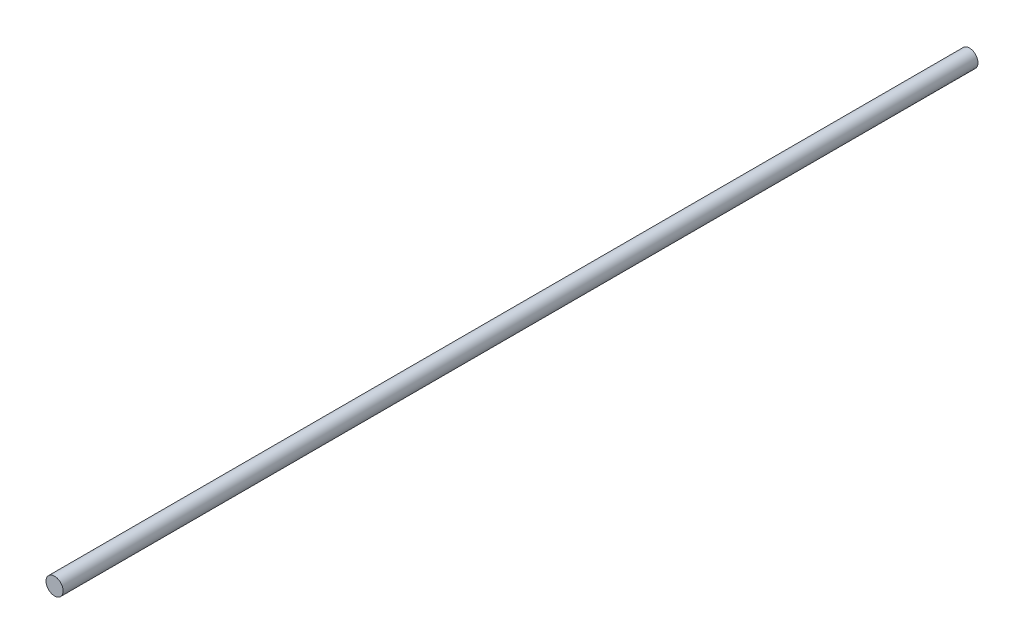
ISO-10303-21;
HEADER;
FILE_DESCRIPTION(('STEP AP214'),'2;1');
FILE_NAME('part.step','',(''),(''),'','','');
FILE_SCHEMA(('AUTOMOTIVE_DESIGN { 1 0 10303 214 1 1 1 1 }'));
ENDSEC;
DATA;
#1=APPLICATION_CONTEXT('core data for automotive mechanical design processes');
#2=APPLICATION_PROTOCOL_DEFINITION('international standard','automotive_design',2000,#1);
#3=PRODUCT_CONTEXT('',#1,'mechanical');
#4=PRODUCT('Part','Part','',(#3));
#5=PRODUCT_RELATED_PRODUCT_CATEGORY('part','',(#4));
#6=PRODUCT_DEFINITION_FORMATION('','',#4);
#7=PRODUCT_DEFINITION_CONTEXT('part definition',#1,'design');
#8=PRODUCT_DEFINITION('design','',#6,#7);
#9=PRODUCT_DEFINITION_SHAPE('','',#8);
#10=(LENGTH_UNIT() NAMED_UNIT(*) SI_UNIT(.MILLI.,.METRE.));
#11=(NAMED_UNIT(*) PLANE_ANGLE_UNIT() SI_UNIT($,.RADIAN.));
#12=(NAMED_UNIT(*) SI_UNIT($,.STERADIAN.) SOLID_ANGLE_UNIT());
#13=UNCERTAINTY_MEASURE_WITH_UNIT(LENGTH_MEASURE(1.E-05),#10,'distance_accuracy_value','');
#14=(GEOMETRIC_REPRESENTATION_CONTEXT(3) GLOBAL_UNCERTAINTY_ASSIGNED_CONTEXT((#13)) GLOBAL_UNIT_ASSIGNED_CONTEXT((#10,
#11,#12)) REPRESENTATION_CONTEXT('',''));
#15=CARTESIAN_POINT('',(0.,0.,0.));
#16=DIRECTION('',(0.,0.,1.));
#17=DIRECTION('',(1.,0.,0.));
#18=AXIS2_PLACEMENT_3D('',#15,#16,#17);
#19=CARTESIAN_POINT('',(0.,0.,-3200.));
#20=DIRECTION('',(0.,0.,1.));
#21=DIRECTION('',(1.,0.,0.));
#22=AXIS2_PLACEMENT_3D('',#19,#20,#21);
#23=CYLINDRICAL_SURFACE('',#22,30.);
#24=CARTESIAN_POINT('',(0.,0.,-3200.));
#25=DIRECTION('',(0.,0.,1.));
#26=DIRECTION('',(1.,0.,0.));
#27=AXIS2_PLACEMENT_3D('',#24,#25,#26);
#28=CIRCLE('',#27,30.);
#29=CARTESIAN_POINT('',(30.,0.,-3200.));
#30=VERTEX_POINT('',#29);
#31=EDGE_CURVE('E10',#30,#30,#28,.T.);
#32=ORIENTED_EDGE('',*,*,#31,.T.);
#33=EDGE_LOOP('',(#32));
#34=FACE_BOUND('',#33,.T.);
#35=CARTESIAN_POINT('',(0.,0.,0.));
#36=DIRECTION('',(0.,0.,1.));
#37=DIRECTION('',(1.,0.,0.));
#38=AXIS2_PLACEMENT_3D('',#35,#36,#37);
#39=CIRCLE('',#38,30.);
#40=CARTESIAN_POINT('',(30.,0.,0.));
#41=VERTEX_POINT('',#40);
#42=EDGE_CURVE('E40',#41,#41,#39,.T.);
#43=ORIENTED_EDGE('',*,*,#42,.F.);
#44=EDGE_LOOP('',(#43));
#45=FACE_BOUND('',#44,.T.);
#46=ADVANCED_FACE('F37',(#34,#45),#23,.T.);
#47=CARTESIAN_POINT('',(0.,0.,-3200.));
#48=DIRECTION('',(0.,0.,1.));
#49=DIRECTION('',(1.,0.,0.));
#50=AXIS2_PLACEMENT_3D('',#47,#48,#49);
#51=PLANE('',#50);
#52=ORIENTED_EDGE('',*,*,#31,.F.);
#53=EDGE_LOOP('',(#52));
#54=FACE_BOUND('',#53,.T.);
#55=ADVANCED_FACE('F54',(#54),#51,.F.);
#56=CARTESIAN_POINT('',(0.,0.,0.));
#57=DIRECTION('',(0.,0.,1.));
#58=DIRECTION('',(1.,0.,0.));
#59=AXIS2_PLACEMENT_3D('',#56,#57,#58);
#60=PLANE('',#59);
#61=ORIENTED_EDGE('',*,*,#42,.T.);
#62=EDGE_LOOP('',(#61));
#63=FACE_BOUND('',#62,.T.);
#64=ADVANCED_FACE('F51',(#63),#60,.T.);
#65=CLOSED_SHELL('',(#46,#55,#64));
#66=MANIFOLD_SOLID_BREP('B2',#65);
#67=ADVANCED_BREP_SHAPE_REPRESENTATION('',(#18,#66),#14);
#68=SHAPE_DEFINITION_REPRESENTATION(#9,#67);
ENDSEC;
END-ISO-10303-21;
